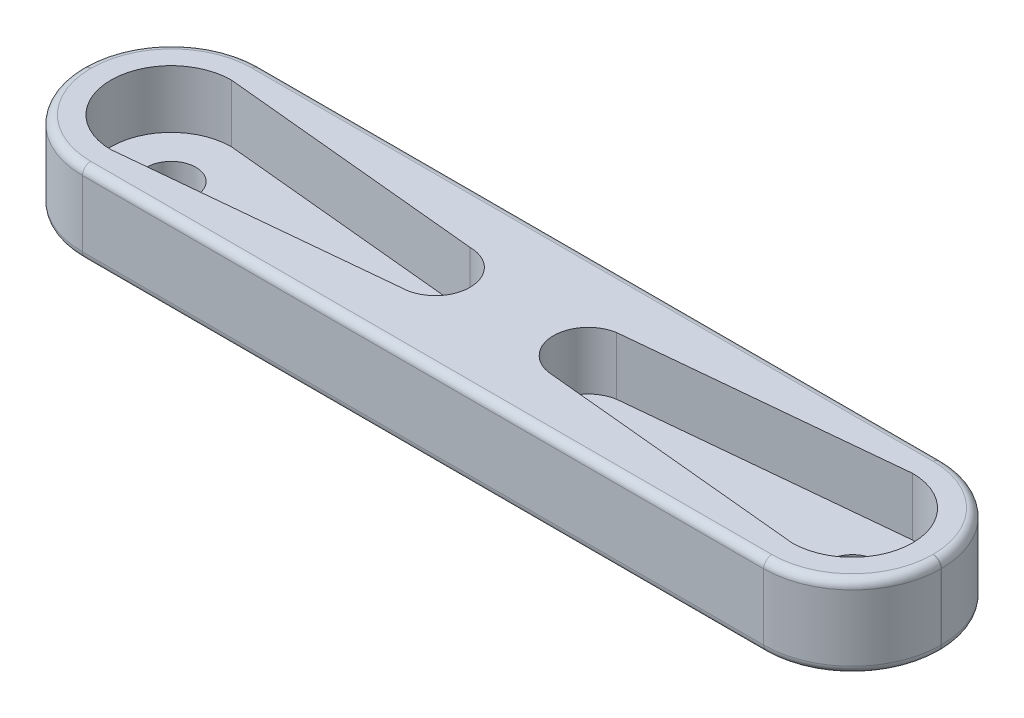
ISO-10303-21;
HEADER;
FILE_DESCRIPTION(('STEP AP214'),'2;1');
FILE_NAME('part.step','',(''),(''),'','','');
FILE_SCHEMA(('AUTOMOTIVE_DESIGN { 1 0 10303 214 1 1 1 1 }'));
ENDSEC;
DATA;
#1=APPLICATION_CONTEXT('core data for automotive mechanical design processes');
#2=APPLICATION_PROTOCOL_DEFINITION('international standard','automotive_design',2000,#1);
#3=PRODUCT_CONTEXT('',#1,'mechanical');
#4=PRODUCT('Part','Part','',(#3));
#5=PRODUCT_RELATED_PRODUCT_CATEGORY('part','',(#4));
#6=PRODUCT_DEFINITION_FORMATION('','',#4);
#7=PRODUCT_DEFINITION_CONTEXT('part definition',#1,'design');
#8=PRODUCT_DEFINITION('design','',#6,#7);
#9=PRODUCT_DEFINITION_SHAPE('','',#8);
#10=(LENGTH_UNIT() NAMED_UNIT(*) SI_UNIT(.MILLI.,.METRE.));
#11=(NAMED_UNIT(*) PLANE_ANGLE_UNIT() SI_UNIT($,.RADIAN.));
#12=(NAMED_UNIT(*) SI_UNIT($,.STERADIAN.) SOLID_ANGLE_UNIT());
#13=UNCERTAINTY_MEASURE_WITH_UNIT(LENGTH_MEASURE(1.E-05),#10,'distance_accuracy_value','');
#14=(GEOMETRIC_REPRESENTATION_CONTEXT(3) GLOBAL_UNCERTAINTY_ASSIGNED_CONTEXT((#13)) GLOBAL_UNIT_ASSIGNED_CONTEXT((#10,
#11,#12)) REPRESENTATION_CONTEXT('',''));
#15=CARTESIAN_POINT('',(0.,0.,0.));
#16=DIRECTION('',(0.,0.,1.));
#17=DIRECTION('',(1.,0.,0.));
#18=AXIS2_PLACEMENT_3D('',#15,#16,#17);
#19=CARTESIAN_POINT('',(0.,5.,0.));
#20=DIRECTION('',(0.,-1.,0.));
#21=DIRECTION('',(0.,0.,-1.));
#22=AXIS2_PLACEMENT_3D('',#19,#20,#21);
#23=PLANE('',#22);
#24=DIRECTION('',(0.,0.,1.));
#25=VECTOR('',#24,1.);
#26=CARTESIAN_POINT('',(-25.5,5.,0.));
#27=LINE('',#26,#25);
#28=CARTESIAN_POINT('',(-25.5,5.,-0.0149999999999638));
#29=VERTEX_POINT('',#28);
#30=CARTESIAN_POINT('',(-25.5,5.,0.0149999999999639));
#31=VERTEX_POINT('',#30);
#32=EDGE_CURVE('E49',#29,#31,#27,.T.);
#33=ORIENTED_EDGE('',*,*,#32,.T.);
#34=CARTESIAN_POINT('',(-20.63,5.,0.0149999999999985));
#35=DIRECTION('',(0.,-1.,0.));
#36=DIRECTION('',(0.,0.,-1.));
#37=AXIS2_PLACEMENT_3D('',#34,#35,#36);
#38=CIRCLE('',#37,4.87);
#39=CARTESIAN_POINT('',(-20.63,5.,4.885));
#40=VERTEX_POINT('',#39);
#41=EDGE_CURVE('E330',#31,#40,#38,.F.);
#42=ORIENTED_EDGE('',*,*,#41,.T.);
#43=DIRECTION('',(1.,0.,0.));
#44=VECTOR('',#43,1.);
#45=CARTESIAN_POINT('',(0.,5.,4.885));
#46=LINE('',#45,#44);
#47=CARTESIAN_POINT('',(20.63,5.,4.885));
#48=VERTEX_POINT('',#47);
#49=EDGE_CURVE('E318',#40,#48,#46,.T.);
#50=ORIENTED_EDGE('',*,*,#49,.T.);
#51=CARTESIAN_POINT('',(20.63,5.,0.0149999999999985));
#52=DIRECTION('',(0.,-1.,0.));
#53=DIRECTION('',(0.,0.,-1.));
#54=AXIS2_PLACEMENT_3D('',#51,#52,#53);
#55=CIRCLE('',#54,4.87);
#56=CARTESIAN_POINT('',(25.5,5.,0.0149999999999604));
#57=VERTEX_POINT('',#56);
#58=EDGE_CURVE('E320',#48,#57,#55,.F.);
#59=ORIENTED_EDGE('',*,*,#58,.T.);
#60=DIRECTION('',(0.,0.,-1.));
#61=VECTOR('',#60,1.);
#62=CARTESIAN_POINT('',(25.5,5.,0.));
#63=LINE('',#62,#61);
#64=CARTESIAN_POINT('',(25.5,5.,-0.0149999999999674));
#65=VERTEX_POINT('',#64);
#66=EDGE_CURVE('E322',#57,#65,#63,.T.);
#67=ORIENTED_EDGE('',*,*,#66,.T.);
#68=CARTESIAN_POINT('',(20.63,5.,-0.015000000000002));
#69=DIRECTION('',(0.,-1.,0.));
#70=DIRECTION('',(0.,0.,-1.));
#71=AXIS2_PLACEMENT_3D('',#68,#69,#70);
#72=CIRCLE('',#71,4.87);
#73=CARTESIAN_POINT('',(20.63,5.,-4.885));
#74=VERTEX_POINT('',#73);
#75=EDGE_CURVE('E324',#65,#74,#72,.F.);
#76=ORIENTED_EDGE('',*,*,#75,.T.);
#77=DIRECTION('',(-1.,0.,0.));
#78=VECTOR('',#77,1.);
#79=CARTESIAN_POINT('',(0.,5.,-4.885));
#80=LINE('',#79,#78);
#81=CARTESIAN_POINT('',(-20.63,5.,-4.885));
#82=VERTEX_POINT('',#81);
#83=EDGE_CURVE('E326',#74,#82,#80,.T.);
#84=ORIENTED_EDGE('',*,*,#83,.T.);
#85=CARTESIAN_POINT('',(-20.63,5.,-0.015000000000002));
#86=DIRECTION('',(0.,-1.,0.));
#87=DIRECTION('',(0.,0.,-1.));
#88=AXIS2_PLACEMENT_3D('',#85,#86,#87);
#89=CIRCLE('',#88,4.87);
#90=EDGE_CURVE('E54',#82,#29,#89,.F.);
#91=ORIENTED_EDGE('',*,*,#90,.T.);
#92=EDGE_LOOP('',(#33,#42,#50,#59,#67,#76,#84,#91));
#93=FACE_BOUND('',#92,.T.);
#94=CARTESIAN_POINT('',(-4.63000000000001,5.,0.0149999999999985));
#95=DIRECTION('',(0.,1.,0.));
#96=DIRECTION('',(0.,0.,1.));
#97=AXIS2_PLACEMENT_3D('',#94,#95,#96);
#98=CIRCLE('',#97,2.1);
#99=CARTESIAN_POINT('',(-4.63000000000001,5.,2.115));
#100=VERTEX_POINT('',#99);
#101=CARTESIAN_POINT('',(-4.63000000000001,5.,-2.085));
#102=VERTEX_POINT('',#101);
#103=EDGE_CURVE('E221',#100,#102,#98,.T.);
#104=ORIENTED_EDGE('',*,*,#103,.F.);
#105=DIRECTION('',(-0.995340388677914,0.,0.0964236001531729));
#106=VECTOR('',#105,1.);
#107=CARTESIAN_POINT('',(0.159938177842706,5.,1.65097473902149));
#108=LINE('',#107,#106);
#109=CARTESIAN_POINT('',(-20.63,5.,3.665));
#110=VERTEX_POINT('',#109);
#111=EDGE_CURVE('E212',#100,#110,#108,.T.);
#112=ORIENTED_EDGE('',*,*,#111,.T.);
#113=CARTESIAN_POINT('',(-20.63,5.,0.0149999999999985));
#114=DIRECTION('',(0.,1.,0.));
#115=DIRECTION('',(0.,0.,1.));
#116=AXIS2_PLACEMENT_3D('',#113,#114,#115);
#117=CIRCLE('',#116,3.65);
#118=CARTESIAN_POINT('',(-20.63,5.,-3.635));
#119=VERTEX_POINT('',#118);
#120=EDGE_CURVE('E206',#119,#110,#117,.T.);
#121=ORIENTED_EDGE('',*,*,#120,.F.);
#122=DIRECTION('',(0.995340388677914,0.,0.0964236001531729));
#123=VECTOR('',#122,1.);
#124=CARTESIAN_POINT('',(0.157058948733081,5.,-1.62125366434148));
#125=LINE('',#124,#123);
#126=EDGE_CURVE('E247',#119,#102,#125,.T.);
#127=ORIENTED_EDGE('',*,*,#126,.T.);
#128=EDGE_LOOP('',(#104,#112,#121,#127));
#129=FACE_BOUND('',#128,.T.);
#130=DIRECTION('',(-0.99536604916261,0.,-0.0961583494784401));
#131=VECTOR('',#130,1.);
#132=CARTESIAN_POINT('',(-0.160033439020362,5.,1.65655767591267));
#133=LINE('',#132,#131);
#134=CARTESIAN_POINT('',(20.63,5.,3.665));
#135=VERTEX_POINT('',#134);
#136=CARTESIAN_POINT('',(4.27813001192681,5.,2.08531096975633));
#137=VERTEX_POINT('',#136);
#138=EDGE_CURVE('E266',#135,#137,#133,.T.);
#139=ORIENTED_EDGE('',*,*,#138,.T.);
#140=CARTESIAN_POINT('',(4.62999999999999,5.,0.0150000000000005));
#141=DIRECTION('',(0.,1.,0.));
#142=DIRECTION('',(0.,0.,1.));
#143=AXIS2_PLACEMENT_3D('',#140,#141,#142);
#144=CIRCLE('',#143,2.1);
#145=CARTESIAN_POINT('',(4.27813001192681,5.,-2.05531096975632));
#146=VERTEX_POINT('',#145);
#147=EDGE_CURVE('E235',#146,#137,#144,.T.);
#148=ORIENTED_EDGE('',*,*,#147,.F.);
#149=DIRECTION('',(-0.995366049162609,0.,0.0961583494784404));
#150=VECTOR('',#149,1.);
#151=CARTESIAN_POINT('',(-0.157162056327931,5.,-1.6268350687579));
#152=LINE('',#151,#150);
#153=CARTESIAN_POINT('',(20.63,5.,-3.635));
#154=VERTEX_POINT('',#153);
#155=EDGE_CURVE('E229',#154,#146,#152,.T.);
#156=ORIENTED_EDGE('',*,*,#155,.F.);
#157=CARTESIAN_POINT('',(20.63,5.,0.0149999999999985));
#158=DIRECTION('',(0.,1.,0.));
#159=DIRECTION('',(0.,0.,1.));
#160=AXIS2_PLACEMENT_3D('',#157,#158,#159);
#161=CIRCLE('',#160,3.65);
#162=EDGE_CURVE('E259',#135,#154,#161,.T.);
#163=ORIENTED_EDGE('',*,*,#162,.F.);
#164=EDGE_LOOP('',(#139,#148,#156,#163));
#165=FACE_BOUND('',#164,.T.);
#166=ADVANCED_FACE('F32',(#93,#129,#165),#23,.F.);
#167=CARTESIAN_POINT('',(-26.,5.,-5.385));
#168=DIRECTION('',(0.,0.,1.));
#169=DIRECTION('',(1.,0.,0.));
#170=AXIS2_PLACEMENT_3D('',#167,#168,#169);
#171=PLANE('',#170);
#172=DIRECTION('',(0.,1.,0.));
#173=VECTOR('',#172,1.);
#174=CARTESIAN_POINT('',(20.63,0.,-5.385));
#175=LINE('',#174,#173);
#176=CARTESIAN_POINT('',(20.63,0.5,-5.385));
#177=VERTEX_POINT('',#176);
#178=CARTESIAN_POINT('',(20.63,4.5,-5.385));
#179=VERTEX_POINT('',#178);
#180=EDGE_CURVE('E395',#177,#179,#175,.T.);
#181=ORIENTED_EDGE('',*,*,#180,.F.);
#182=DIRECTION('',(-1.,0.,0.));
#183=VECTOR('',#182,1.);
#184=CARTESIAN_POINT('',(-20.63,0.5,-5.385));
#185=LINE('',#184,#183);
#186=CARTESIAN_POINT('',(-20.63,0.5,-5.385));
#187=VERTEX_POINT('',#186);
#188=EDGE_CURVE('E304',#177,#187,#185,.T.);
#189=ORIENTED_EDGE('',*,*,#188,.T.);
#190=DIRECTION('',(0.,1.,0.));
#191=VECTOR('',#190,1.);
#192=CARTESIAN_POINT('',(-20.63,0.,-5.385));
#193=LINE('',#192,#191);
#194=CARTESIAN_POINT('',(-20.63,4.5,-5.385));
#195=VERTEX_POINT('',#194);
#196=EDGE_CURVE('E226',#187,#195,#193,.T.);
#197=ORIENTED_EDGE('',*,*,#196,.T.);
#198=DIRECTION('',(-1.,0.,0.));
#199=VECTOR('',#198,1.);
#200=CARTESIAN_POINT('',(-26.,4.5,-5.385));
#201=LINE('',#200,#199);
#202=EDGE_CURVE('E302',#195,#179,#201,.F.);
#203=ORIENTED_EDGE('',*,*,#202,.T.);
#204=EDGE_LOOP('',(#181,#189,#197,#203));
#205=FACE_BOUND('',#204,.T.);
#206=ADVANCED_FACE('F496',(#205),#171,.F.);
#207=CARTESIAN_POINT('',(-26.,5.,5.385));
#208=DIRECTION('',(1.,0.,0.));
#209=DIRECTION('',(0.,0.,-1.));
#210=AXIS2_PLACEMENT_3D('',#207,#208,#209);
#211=PLANE('',#210);
#212=DIRECTION('',(0.,1.,0.));
#213=VECTOR('',#212,1.);
#214=CARTESIAN_POINT('',(-26.,0.,-0.0149999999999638));
#215=LINE('',#214,#213);
#216=CARTESIAN_POINT('',(-26.,0.5,-0.0149999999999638));
#217=VERTEX_POINT('',#216);
#218=CARTESIAN_POINT('',(-26.,4.5,-0.0149999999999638));
#219=VERTEX_POINT('',#218);
#220=EDGE_CURVE('E238',#217,#219,#215,.T.);
#221=ORIENTED_EDGE('',*,*,#220,.F.);
#222=DIRECTION('',(0.,0.,1.));
#223=VECTOR('',#222,1.);
#224=CARTESIAN_POINT('',(-26.,0.5,0.0149999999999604));
#225=LINE('',#224,#223);
#226=CARTESIAN_POINT('',(-26.,0.5,0.0149999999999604));
#227=VERTEX_POINT('',#226);
#228=EDGE_CURVE('E296',#217,#227,#225,.T.);
#229=ORIENTED_EDGE('',*,*,#228,.T.);
#230=DIRECTION('',(0.,1.,0.));
#231=VECTOR('',#230,1.);
#232=CARTESIAN_POINT('',(-26.,0.,0.0149999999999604));
#233=LINE('',#232,#231);
#234=CARTESIAN_POINT('',(-26.,4.5,0.0149999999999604));
#235=VERTEX_POINT('',#234);
#236=EDGE_CURVE('E418',#227,#235,#233,.T.);
#237=ORIENTED_EDGE('',*,*,#236,.T.);
#238=DIRECTION('',(0.,0.,1.));
#239=VECTOR('',#238,1.);
#240=CARTESIAN_POINT('',(-26.,4.5,5.385));
#241=LINE('',#240,#239);
#242=EDGE_CURVE('E294',#235,#219,#241,.F.);
#243=ORIENTED_EDGE('',*,*,#242,.T.);
#244=EDGE_LOOP('',(#221,#229,#237,#243));
#245=FACE_BOUND('',#244,.T.);
#246=ADVANCED_FACE('F501',(#245),#211,.F.);
#247=CARTESIAN_POINT('',(-26.,5.,5.385));
#248=DIRECTION('',(0.,0.,-1.));
#249=DIRECTION('',(-1.,0.,0.));
#250=AXIS2_PLACEMENT_3D('',#247,#248,#249);
#251=PLANE('',#250);
#252=DIRECTION('',(0.,1.,0.));
#253=VECTOR('',#252,1.);
#254=CARTESIAN_POINT('',(-20.63,0.,5.385));
#255=LINE('',#254,#253);
#256=CARTESIAN_POINT('',(-20.63,0.5,5.385));
#257=VERTEX_POINT('',#256);
#258=CARTESIAN_POINT('',(-20.63,4.5,5.385));
#259=VERTEX_POINT('',#258);
#260=EDGE_CURVE('E414',#257,#259,#255,.T.);
#261=ORIENTED_EDGE('',*,*,#260,.F.);
#262=DIRECTION('',(1.,0.,0.));
#263=VECTOR('',#262,1.);
#264=CARTESIAN_POINT('',(20.63,0.5,5.385));
#265=LINE('',#264,#263);
#266=CARTESIAN_POINT('',(20.63,0.5,5.385));
#267=VERTEX_POINT('',#266);
#268=EDGE_CURVE('E11',#257,#267,#265,.T.);
#269=ORIENTED_EDGE('',*,*,#268,.T.);
#270=DIRECTION('',(0.,1.,0.));
#271=VECTOR('',#270,1.);
#272=CARTESIAN_POINT('',(20.63,0.,5.385));
#273=LINE('',#272,#271);
#274=CARTESIAN_POINT('',(20.63,4.5,5.385));
#275=VERTEX_POINT('',#274);
#276=EDGE_CURVE('E424',#267,#275,#273,.T.);
#277=ORIENTED_EDGE('',*,*,#276,.T.);
#278=DIRECTION('',(1.,0.,0.));
#279=VECTOR('',#278,1.);
#280=CARTESIAN_POINT('',(-26.,4.5,5.385));
#281=LINE('',#280,#279);
#282=EDGE_CURVE('E41',#275,#259,#281,.F.);
#283=ORIENTED_EDGE('',*,*,#282,.T.);
#284=EDGE_LOOP('',(#261,#269,#277,#283));
#285=FACE_BOUND('',#284,.T.);
#286=ADVANCED_FACE('F446',(#285),#251,.F.);
#287=CARTESIAN_POINT('',(0.,0.,0.));
#288=DIRECTION('',(0.,-1.,0.));
#289=DIRECTION('',(0.,0.,-1.));
#290=AXIS2_PLACEMENT_3D('',#287,#288,#289);
#291=PLANE('',#290);
#292=DIRECTION('',(1.,0.,0.));
#293=VECTOR('',#292,1.);
#294=CARTESIAN_POINT('',(-20.63,0.,4.885));
#295=LINE('',#294,#293);
#296=CARTESIAN_POINT('',(20.63,0.,4.885));
#297=VERTEX_POINT('',#296);
#298=CARTESIAN_POINT('',(-20.63,0.,4.885));
#299=VERTEX_POINT('',#298);
#300=EDGE_CURVE('E277',#297,#299,#295,.F.);
#301=ORIENTED_EDGE('',*,*,#300,.T.);
#302=CARTESIAN_POINT('',(-20.63,0.,0.0149999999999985));
#303=DIRECTION('',(0.,-1.,0.));
#304=DIRECTION('',(0.,0.,-1.));
#305=AXIS2_PLACEMENT_3D('',#302,#303,#304);
#306=CIRCLE('',#305,4.87);
#307=CARTESIAN_POINT('',(-25.5,0.,0.0149999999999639));
#308=VERTEX_POINT('',#307);
#309=EDGE_CURVE('E291',#299,#308,#306,.T.);
#310=ORIENTED_EDGE('',*,*,#309,.T.);
#311=DIRECTION('',(0.,0.,1.));
#312=VECTOR('',#311,1.);
#313=CARTESIAN_POINT('',(-25.5,0.,-0.0149999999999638));
#314=LINE('',#313,#312);
#315=CARTESIAN_POINT('',(-25.5,0.,-0.0149999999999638));
#316=VERTEX_POINT('',#315);
#317=EDGE_CURVE('E289',#308,#316,#314,.F.);
#318=ORIENTED_EDGE('',*,*,#317,.T.);
#319=CARTESIAN_POINT('',(-20.63,0.,-0.015000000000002));
#320=DIRECTION('',(0.,-1.,0.));
#321=DIRECTION('',(0.,0.,-1.));
#322=AXIS2_PLACEMENT_3D('',#319,#320,#321);
#323=CIRCLE('',#322,4.87);
#324=CARTESIAN_POINT('',(-20.63,0.,-4.885));
#325=VERTEX_POINT('',#324);
#326=EDGE_CURVE('E287',#316,#325,#323,.T.);
#327=ORIENTED_EDGE('',*,*,#326,.T.);
#328=DIRECTION('',(-1.,0.,0.));
#329=VECTOR('',#328,1.);
#330=CARTESIAN_POINT('',(20.6299999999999,0.,-4.885));
#331=LINE('',#330,#329);
#332=CARTESIAN_POINT('',(20.63,0.,-4.885));
#333=VERTEX_POINT('',#332);
#334=EDGE_CURVE('E285',#325,#333,#331,.F.);
#335=ORIENTED_EDGE('',*,*,#334,.T.);
#336=CARTESIAN_POINT('',(20.63,0.,-0.015000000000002));
#337=DIRECTION('',(0.,-1.,0.));
#338=DIRECTION('',(0.,0.,-1.));
#339=AXIS2_PLACEMENT_3D('',#336,#337,#338);
#340=CIRCLE('',#339,4.87);
#341=CARTESIAN_POINT('',(25.5,0.,-0.0149999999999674));
#342=VERTEX_POINT('',#341);
#343=EDGE_CURVE('E283',#333,#342,#340,.T.);
#344=ORIENTED_EDGE('',*,*,#343,.T.);
#345=DIRECTION('',(0.,0.,-1.));
#346=VECTOR('',#345,1.);
#347=CARTESIAN_POINT('',(25.5,0.,0.0149999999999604));
#348=LINE('',#347,#346);
#349=CARTESIAN_POINT('',(25.5,0.,0.0149999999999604));
#350=VERTEX_POINT('',#349);
#351=EDGE_CURVE('E281',#342,#350,#348,.F.);
#352=ORIENTED_EDGE('',*,*,#351,.T.);
#353=CARTESIAN_POINT('',(20.63,0.,0.0149999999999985));
#354=DIRECTION('',(0.,-1.,0.));
#355=DIRECTION('',(0.,0.,-1.));
#356=AXIS2_PLACEMENT_3D('',#353,#354,#355);
#357=CIRCLE('',#356,4.87);
#358=EDGE_CURVE('E279',#350,#297,#357,.T.);
#359=ORIENTED_EDGE('',*,*,#358,.T.);
#360=EDGE_LOOP('',(#301,#310,#318,#327,#335,#344,#352,#359));
#361=FACE_BOUND('',#360,.T.);
#362=CARTESIAN_POINT('',(-20.63,0.,0.0149999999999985));
#363=DIRECTION('',(0.,1.,0.));
#364=DIRECTION('',(0.,0.,1.));
#365=AXIS2_PLACEMENT_3D('',#362,#363,#364);
#366=CIRCLE('',#365,1.5);
#367=CARTESIAN_POINT('',(-20.63,0.,1.515));
#368=VERTEX_POINT('',#367);
#369=EDGE_CURVE('E834',#368,#368,#366,.T.);
#370=ORIENTED_EDGE('',*,*,#369,.T.);
#371=EDGE_LOOP('',(#370));
#372=FACE_BOUND('',#371,.T.);
#373=CARTESIAN_POINT('',(20.63,0.,0.0149999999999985));
#374=DIRECTION('',(0.,1.,0.));
#375=DIRECTION('',(0.,0.,1.));
#376=AXIS2_PLACEMENT_3D('',#373,#374,#375);
#377=CIRCLE('',#376,1.5);
#378=CARTESIAN_POINT('',(20.63,0.,1.515));
#379=VERTEX_POINT('',#378);
#380=EDGE_CURVE('E355',#379,#379,#377,.T.);
#381=ORIENTED_EDGE('',*,*,#380,.T.);
#382=EDGE_LOOP('',(#381));
#383=FACE_BOUND('',#382,.T.);
#384=ADVANCED_FACE('F459',(#361,#372,#383),#291,.T.);
#385=CARTESIAN_POINT('',(26.,5.,5.385));
#386=DIRECTION('',(-1.,0.,0.));
#387=DIRECTION('',(0.,0.,1.));
#388=AXIS2_PLACEMENT_3D('',#385,#386,#387);
#389=PLANE('',#388);
#390=DIRECTION('',(0.,1.,0.));
#391=VECTOR('',#390,1.);
#392=CARTESIAN_POINT('',(26.,0.,0.0149999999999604));
#393=LINE('',#392,#391);
#394=CARTESIAN_POINT('',(26.,0.5,0.0149999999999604));
#395=VERTEX_POINT('',#394);
#396=CARTESIAN_POINT('',(26.,4.5,0.0149999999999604));
#397=VERTEX_POINT('',#396);
#398=EDGE_CURVE('E403',#395,#397,#393,.T.);
#399=ORIENTED_EDGE('',*,*,#398,.F.);
#400=DIRECTION('',(0.,0.,-1.));
#401=VECTOR('',#400,1.);
#402=CARTESIAN_POINT('',(26.,0.5,-0.0149999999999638));
#403=LINE('',#402,#401);
#404=CARTESIAN_POINT('',(26.,0.5,-0.0149999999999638));
#405=VERTEX_POINT('',#404);
#406=EDGE_CURVE('E312',#395,#405,#403,.T.);
#407=ORIENTED_EDGE('',*,*,#406,.T.);
#408=DIRECTION('',(0.,1.,0.));
#409=VECTOR('',#408,1.);
#410=CARTESIAN_POINT('',(26.,0.,-0.0149999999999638));
#411=LINE('',#410,#409);
#412=CARTESIAN_POINT('',(26.,4.5,-0.0149999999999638));
#413=VERTEX_POINT('',#412);
#414=EDGE_CURVE('E392',#405,#413,#411,.T.);
#415=ORIENTED_EDGE('',*,*,#414,.T.);
#416=DIRECTION('',(0.,0.,-1.));
#417=VECTOR('',#416,1.);
#418=CARTESIAN_POINT('',(26.,4.5,5.385));
#419=LINE('',#418,#417);
#420=EDGE_CURVE('E310',#413,#397,#419,.F.);
#421=ORIENTED_EDGE('',*,*,#420,.T.);
#422=EDGE_LOOP('',(#399,#407,#415,#421));
#423=FACE_BOUND('',#422,.T.);
#424=ADVANCED_FACE('F398',(#423),#389,.F.);
#425=CARTESIAN_POINT('',(-0.157162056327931,1.5,-1.6268350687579));
#426=DIRECTION('',(-0.0961583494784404,0.,-0.995366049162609));
#427=DIRECTION('',(-0.995366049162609,0.,0.0961583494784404));
#428=AXIS2_PLACEMENT_3D('',#425,#426,#427);
#429=PLANE('',#428);
#430=ORIENTED_EDGE('',*,*,#155,.T.);
#431=DIRECTION('',(0.,1.,0.));
#432=VECTOR('',#431,1.);
#433=CARTESIAN_POINT('',(4.27813001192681,1.5,-2.05531096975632));
#434=LINE('',#433,#432);
#435=CARTESIAN_POINT('',(4.27813001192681,1.5,-2.05531096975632));
#436=VERTEX_POINT('',#435);
#437=EDGE_CURVE('E234',#436,#146,#434,.T.);
#438=ORIENTED_EDGE('',*,*,#437,.F.);
#439=DIRECTION('',(-0.995366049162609,0.,0.0961583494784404));
#440=VECTOR('',#439,1.);
#441=CARTESIAN_POINT('',(-0.157162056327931,1.5,-1.6268350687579));
#442=LINE('',#441,#440);
#443=CARTESIAN_POINT('',(20.63,1.5,-3.635));
#444=VERTEX_POINT('',#443);
#445=EDGE_CURVE('E256',#444,#436,#442,.T.);
#446=ORIENTED_EDGE('',*,*,#445,.F.);
#447=DIRECTION('',(0.,1.,0.));
#448=VECTOR('',#447,1.);
#449=CARTESIAN_POINT('',(20.63,1.5,-3.635));
#450=LINE('',#449,#448);
#451=EDGE_CURVE('E248',#444,#154,#450,.T.);
#452=ORIENTED_EDGE('',*,*,#451,.T.);
#453=EDGE_LOOP('',(#430,#438,#446,#452));
#454=FACE_BOUND('',#453,.T.);
#455=ADVANCED_FACE('F506',(#454),#429,.F.);
#456=CARTESIAN_POINT('',(20.63,1.5,0.0149999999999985));
#457=DIRECTION('',(0.,1.,0.));
#458=DIRECTION('',(0.,0.,1.));
#459=AXIS2_PLACEMENT_3D('',#456,#457,#458);
#460=CYLINDRICAL_SURFACE('',#459,3.65);
#461=ORIENTED_EDGE('',*,*,#162,.T.);
#462=ORIENTED_EDGE('',*,*,#451,.F.);
#463=CARTESIAN_POINT('',(20.63,1.5,0.0149999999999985));
#464=DIRECTION('',(0.,1.,0.));
#465=DIRECTION('',(0.,0.,1.));
#466=AXIS2_PLACEMENT_3D('',#463,#464,#465);
#467=CIRCLE('',#466,3.65);
#468=CARTESIAN_POINT('',(20.63,1.5,3.665));
#469=VERTEX_POINT('',#468);
#470=EDGE_CURVE('E260',#469,#444,#467,.T.);
#471=ORIENTED_EDGE('',*,*,#470,.F.);
#472=DIRECTION('',(0.,1.,0.));
#473=VECTOR('',#472,1.);
#474=CARTESIAN_POINT('',(20.63,1.5,3.665));
#475=LINE('',#474,#473);
#476=EDGE_CURVE('E263',#469,#135,#475,.T.);
#477=ORIENTED_EDGE('',*,*,#476,.T.);
#478=EDGE_LOOP('',(#461,#462,#471,#477));
#479=FACE_BOUND('',#478,.T.);
#480=ADVANCED_FACE('F781',(#479),#460,.F.);
#481=CARTESIAN_POINT('',(-0.160033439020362,1.5,1.65655767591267));
#482=DIRECTION('',(0.0961583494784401,0.,-0.995366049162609));
#483=DIRECTION('',(-0.99536604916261,0.,-0.0961583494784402));
#484=AXIS2_PLACEMENT_3D('',#481,#482,#483);
#485=PLANE('',#484);
#486=ORIENTED_EDGE('',*,*,#138,.F.);
#487=ORIENTED_EDGE('',*,*,#476,.F.);
#488=DIRECTION('',(-0.99536604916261,0.,-0.0961583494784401));
#489=VECTOR('',#488,1.);
#490=CARTESIAN_POINT('',(-0.160033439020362,1.5,1.65655767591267));
#491=LINE('',#490,#489);
#492=CARTESIAN_POINT('',(4.27813001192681,1.5,2.08531096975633));
#493=VERTEX_POINT('',#492);
#494=EDGE_CURVE('E258',#469,#493,#491,.T.);
#495=ORIENTED_EDGE('',*,*,#494,.T.);
#496=DIRECTION('',(0.,1.,0.));
#497=VECTOR('',#496,1.);
#498=CARTESIAN_POINT('',(4.27813001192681,1.5,2.08531096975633));
#499=LINE('',#498,#497);
#500=EDGE_CURVE('E223',#493,#137,#499,.T.);
#501=ORIENTED_EDGE('',*,*,#500,.T.);
#502=EDGE_LOOP('',(#486,#487,#495,#501));
#503=FACE_BOUND('',#502,.T.);
#504=ADVANCED_FACE('F770',(#503),#485,.T.);
#505=CARTESIAN_POINT('',(0.,1.5,0.));
#506=DIRECTION('',(0.,1.,0.));
#507=DIRECTION('',(0.,0.,1.));
#508=AXIS2_PLACEMENT_3D('',#505,#506,#507);
#509=PLANE('',#508);
#510=ORIENTED_EDGE('',*,*,#445,.T.);
#511=CARTESIAN_POINT('',(4.62999999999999,1.5,0.0150000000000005));
#512=DIRECTION('',(0.,1.,0.));
#513=DIRECTION('',(0.,0.,1.));
#514=AXIS2_PLACEMENT_3D('',#511,#512,#513);
#515=CIRCLE('',#514,2.1);
#516=EDGE_CURVE('E231',#436,#493,#515,.T.);
#517=ORIENTED_EDGE('',*,*,#516,.T.);
#518=ORIENTED_EDGE('',*,*,#494,.F.);
#519=ORIENTED_EDGE('',*,*,#470,.T.);
#520=EDGE_LOOP('',(#510,#517,#518,#519));
#521=FACE_BOUND('',#520,.T.);
#522=CARTESIAN_POINT('',(20.63,1.5,0.0149999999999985));
#523=DIRECTION('',(0.,1.,0.));
#524=DIRECTION('',(0.,0.,1.));
#525=AXIS2_PLACEMENT_3D('',#522,#523,#524);
#526=CIRCLE('',#525,1.5);
#527=CARTESIAN_POINT('',(20.63,1.5,1.515));
#528=VERTEX_POINT('',#527);
#529=EDGE_CURVE('E401',#528,#528,#526,.T.);
#530=ORIENTED_EDGE('',*,*,#529,.F.);
#531=EDGE_LOOP('',(#530));
#532=FACE_BOUND('',#531,.T.);
#533=ADVANCED_FACE('F759',(#521,#532),#509,.T.);
#534=CARTESIAN_POINT('',(0.159938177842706,1.5,1.65097473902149));
#535=DIRECTION('',(-0.0964236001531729,0.,-0.995340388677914));
#536=DIRECTION('',(-0.995340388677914,0.,0.0964236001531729));
#537=AXIS2_PLACEMENT_3D('',#534,#535,#536);
#538=PLANE('',#537);
#539=ORIENTED_EDGE('',*,*,#111,.F.);
#540=DIRECTION('',(0.,1.,0.));
#541=VECTOR('',#540,1.);
#542=CARTESIAN_POINT('',(-4.63000000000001,1.5,2.115));
#543=LINE('',#542,#541);
#544=CARTESIAN_POINT('',(-4.63000000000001,1.5,2.115));
#545=VERTEX_POINT('',#544);
#546=EDGE_CURVE('E209',#545,#100,#543,.T.);
#547=ORIENTED_EDGE('',*,*,#546,.F.);
#548=DIRECTION('',(-0.995340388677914,0.,0.0964236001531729));
#549=VECTOR('',#548,1.);
#550=CARTESIAN_POINT('',(0.159938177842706,1.5,1.65097473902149));
#551=LINE('',#550,#549);
#552=CARTESIAN_POINT('',(-20.63,1.5,3.665));
#553=VERTEX_POINT('',#552);
#554=EDGE_CURVE('E194',#545,#553,#551,.T.);
#555=ORIENTED_EDGE('',*,*,#554,.T.);
#556=DIRECTION('',(0.,1.,0.));
#557=VECTOR('',#556,1.);
#558=CARTESIAN_POINT('',(-20.63,1.5,3.665));
#559=LINE('',#558,#557);
#560=EDGE_CURVE('E252',#553,#110,#559,.T.);
#561=ORIENTED_EDGE('',*,*,#560,.T.);
#562=EDGE_LOOP('',(#539,#547,#555,#561));
#563=FACE_BOUND('',#562,.T.);
#564=ADVANCED_FACE('F210',(#563),#538,.T.);
#565=CARTESIAN_POINT('',(-20.63,1.5,0.0149999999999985));
#566=DIRECTION('',(0.,1.,0.));
#567=DIRECTION('',(0.,0.,1.));
#568=AXIS2_PLACEMENT_3D('',#565,#566,#567);
#569=CYLINDRICAL_SURFACE('',#568,3.65);
#570=ORIENTED_EDGE('',*,*,#120,.T.);
#571=ORIENTED_EDGE('',*,*,#560,.F.);
#572=CARTESIAN_POINT('',(-20.63,1.5,0.0149999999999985));
#573=DIRECTION('',(0.,1.,0.));
#574=DIRECTION('',(0.,0.,1.));
#575=AXIS2_PLACEMENT_3D('',#572,#573,#574);
#576=CIRCLE('',#575,3.65);
#577=CARTESIAN_POINT('',(-20.63,1.5,-3.635));
#578=VERTEX_POINT('',#577);
#579=EDGE_CURVE('E202',#578,#553,#576,.T.);
#580=ORIENTED_EDGE('',*,*,#579,.F.);
#581=DIRECTION('',(0.,1.,0.));
#582=VECTOR('',#581,1.);
#583=CARTESIAN_POINT('',(-20.63,1.5,-3.635));
#584=LINE('',#583,#582);
#585=EDGE_CURVE('E244',#578,#119,#584,.T.);
#586=ORIENTED_EDGE('',*,*,#585,.T.);
#587=EDGE_LOOP('',(#570,#571,#580,#586));
#588=FACE_BOUND('',#587,.T.);
#589=ADVANCED_FACE('F746',(#588),#569,.F.);
#590=CARTESIAN_POINT('',(0.157058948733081,1.5,-1.62125366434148));
#591=DIRECTION('',(-0.0964236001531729,0.,0.995340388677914));
#592=DIRECTION('',(0.995340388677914,0.,0.0964236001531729));
#593=AXIS2_PLACEMENT_3D('',#590,#591,#592);
#594=PLANE('',#593);
#595=ORIENTED_EDGE('',*,*,#126,.F.);
#596=ORIENTED_EDGE('',*,*,#585,.F.);
#597=DIRECTION('',(0.995340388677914,0.,0.0964236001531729));
#598=VECTOR('',#597,1.);
#599=CARTESIAN_POINT('',(0.157058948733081,1.5,-1.62125366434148));
#600=LINE('',#599,#598);
#601=CARTESIAN_POINT('',(-4.63000000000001,1.5,-2.085));
#602=VERTEX_POINT('',#601);
#603=EDGE_CURVE('E205',#578,#602,#600,.T.);
#604=ORIENTED_EDGE('',*,*,#603,.T.);
#605=DIRECTION('',(0.,1.,0.));
#606=VECTOR('',#605,1.);
#607=CARTESIAN_POINT('',(-4.63000000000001,1.5,-2.085));
#608=LINE('',#607,#606);
#609=EDGE_CURVE('E216',#602,#102,#608,.T.);
#610=ORIENTED_EDGE('',*,*,#609,.T.);
#611=EDGE_LOOP('',(#595,#596,#604,#610));
#612=FACE_BOUND('',#611,.T.);
#613=ADVANCED_FACE('F734',(#612),#594,.T.);
#614=CARTESIAN_POINT('',(0.,1.5,0.));
#615=DIRECTION('',(0.,1.,0.));
#616=DIRECTION('',(0.,0.,1.));
#617=AXIS2_PLACEMENT_3D('',#614,#615,#616);
#618=PLANE('',#617);
#619=ORIENTED_EDGE('',*,*,#554,.F.);
#620=CARTESIAN_POINT('',(-4.63000000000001,1.5,0.0149999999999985));
#621=DIRECTION('',(0.,1.,0.));
#622=DIRECTION('',(0.,0.,1.));
#623=AXIS2_PLACEMENT_3D('',#620,#621,#622);
#624=CIRCLE('',#623,2.1);
#625=EDGE_CURVE('E200',#545,#602,#624,.T.);
#626=ORIENTED_EDGE('',*,*,#625,.T.);
#627=ORIENTED_EDGE('',*,*,#603,.F.);
#628=ORIENTED_EDGE('',*,*,#579,.T.);
#629=EDGE_LOOP('',(#619,#626,#627,#628));
#630=FACE_BOUND('',#629,.T.);
#631=CARTESIAN_POINT('',(-20.63,1.5,0.0149999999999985));
#632=DIRECTION('',(0.,1.,0.));
#633=DIRECTION('',(0.,0.,1.));
#634=AXIS2_PLACEMENT_3D('',#631,#632,#633);
#635=CIRCLE('',#634,1.5);
#636=CARTESIAN_POINT('',(-20.63,1.5,1.515));
#637=VERTEX_POINT('',#636);
#638=EDGE_CURVE('E406',#637,#637,#635,.T.);
#639=ORIENTED_EDGE('',*,*,#638,.F.);
#640=EDGE_LOOP('',(#639));
#641=FACE_BOUND('',#640,.T.);
#642=ADVANCED_FACE('F196',(#630,#641),#618,.T.);
#643=CARTESIAN_POINT('',(-4.63000000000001,1.5,0.0149999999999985));
#644=DIRECTION('',(0.,1.,0.));
#645=DIRECTION('',(0.,0.,1.));
#646=AXIS2_PLACEMENT_3D('',#643,#644,#645);
#647=CYLINDRICAL_SURFACE('',#646,2.1);
#648=ORIENTED_EDGE('',*,*,#103,.T.);
#649=ORIENTED_EDGE('',*,*,#609,.F.);
#650=ORIENTED_EDGE('',*,*,#625,.F.);
#651=ORIENTED_EDGE('',*,*,#546,.T.);
#652=EDGE_LOOP('',(#648,#649,#650,#651));
#653=FACE_BOUND('',#652,.T.);
#654=ADVANCED_FACE('F219',(#653),#647,.F.);
#655=CARTESIAN_POINT('',(4.62999999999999,1.5,0.0150000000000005));
#656=DIRECTION('',(0.,1.,0.));
#657=DIRECTION('',(0.,0.,1.));
#658=AXIS2_PLACEMENT_3D('',#655,#656,#657);
#659=CYLINDRICAL_SURFACE('',#658,2.1);
#660=ORIENTED_EDGE('',*,*,#147,.T.);
#661=ORIENTED_EDGE('',*,*,#500,.F.);
#662=ORIENTED_EDGE('',*,*,#516,.F.);
#663=ORIENTED_EDGE('',*,*,#437,.T.);
#664=EDGE_LOOP('',(#660,#661,#662,#663));
#665=FACE_BOUND('',#664,.T.);
#666=ADVANCED_FACE('F686',(#665),#659,.F.);
#667=CARTESIAN_POINT('',(-20.63,0.,-0.015000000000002));
#668=DIRECTION('',(0.,1.,0.));
#669=DIRECTION('',(0.,0.,1.));
#670=AXIS2_PLACEMENT_3D('',#667,#668,#669);
#671=CYLINDRICAL_SURFACE('',#670,5.37);
#672=ORIENTED_EDGE('',*,*,#196,.F.);
#673=CARTESIAN_POINT('',(-20.63,0.5,-0.015000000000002));
#674=DIRECTION('',(0.,-1.,0.));
#675=DIRECTION('',(0.,0.,-1.));
#676=AXIS2_PLACEMENT_3D('',#673,#674,#675);
#677=CIRCLE('',#676,5.37);
#678=EDGE_CURVE('E300',#187,#217,#677,.F.);
#679=ORIENTED_EDGE('',*,*,#678,.T.);
#680=ORIENTED_EDGE('',*,*,#220,.T.);
#681=CARTESIAN_POINT('',(-20.63,4.5,-0.015000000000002));
#682=DIRECTION('',(0.,-1.,0.));
#683=DIRECTION('',(0.,0.,-1.));
#684=AXIS2_PLACEMENT_3D('',#681,#682,#683);
#685=CIRCLE('',#684,5.37);
#686=EDGE_CURVE('E298',#219,#195,#685,.T.);
#687=ORIENTED_EDGE('',*,*,#686,.T.);
#688=EDGE_LOOP('',(#672,#679,#680,#687));
#689=FACE_BOUND('',#688,.T.);
#690=ADVANCED_FACE('F678',(#689),#671,.T.);
#691=CARTESIAN_POINT('',(-20.63,0.,0.0149999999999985));
#692=DIRECTION('',(0.,1.,0.));
#693=DIRECTION('',(0.,0.,1.));
#694=AXIS2_PLACEMENT_3D('',#691,#692,#693);
#695=CYLINDRICAL_SURFACE('',#694,5.37);
#696=ORIENTED_EDGE('',*,*,#236,.F.);
#697=CARTESIAN_POINT('',(-20.63,0.5,0.0149999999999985));
#698=DIRECTION('',(0.,-1.,0.));
#699=DIRECTION('',(0.,0.,-1.));
#700=AXIS2_PLACEMENT_3D('',#697,#698,#699);
#701=CIRCLE('',#700,5.37);
#702=EDGE_CURVE('E274',#227,#257,#701,.F.);
#703=ORIENTED_EDGE('',*,*,#702,.T.);
#704=ORIENTED_EDGE('',*,*,#260,.T.);
#705=CARTESIAN_POINT('',(-20.63,4.5,0.0149999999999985));
#706=DIRECTION('',(0.,-1.,0.));
#707=DIRECTION('',(0.,0.,-1.));
#708=AXIS2_PLACEMENT_3D('',#705,#706,#707);
#709=CIRCLE('',#708,5.37);
#710=EDGE_CURVE('E254',#259,#235,#709,.T.);
#711=ORIENTED_EDGE('',*,*,#710,.T.);
#712=EDGE_LOOP('',(#696,#703,#704,#711));
#713=FACE_BOUND('',#712,.T.);
#714=ADVANCED_FACE('F670',(#713),#695,.T.);
#715=CARTESIAN_POINT('',(20.63,0.,0.0149999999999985));
#716=DIRECTION('',(0.,1.,0.));
#717=DIRECTION('',(0.,0.,1.));
#718=AXIS2_PLACEMENT_3D('',#715,#716,#717);
#719=CYLINDRICAL_SURFACE('',#718,5.37);
#720=ORIENTED_EDGE('',*,*,#276,.F.);
#721=CARTESIAN_POINT('',(20.63,0.5,0.0149999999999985));
#722=DIRECTION('',(0.,-1.,0.));
#723=DIRECTION('',(0.,0.,-1.));
#724=AXIS2_PLACEMENT_3D('',#721,#722,#723);
#725=CIRCLE('',#724,5.37);
#726=EDGE_CURVE('E316',#267,#395,#725,.F.);
#727=ORIENTED_EDGE('',*,*,#726,.T.);
#728=ORIENTED_EDGE('',*,*,#398,.T.);
#729=CARTESIAN_POINT('',(20.63,4.5,0.0149999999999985));
#730=DIRECTION('',(0.,-1.,0.));
#731=DIRECTION('',(0.,0.,-1.));
#732=AXIS2_PLACEMENT_3D('',#729,#730,#731);
#733=CIRCLE('',#732,5.37);
#734=EDGE_CURVE('E314',#397,#275,#733,.T.);
#735=ORIENTED_EDGE('',*,*,#734,.T.);
#736=EDGE_LOOP('',(#720,#727,#728,#735));
#737=FACE_BOUND('',#736,.T.);
#738=ADVANCED_FACE('F432',(#737),#719,.T.);
#739=CARTESIAN_POINT('',(20.63,0.,-0.015000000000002));
#740=DIRECTION('',(0.,1.,0.));
#741=DIRECTION('',(0.,0.,1.));
#742=AXIS2_PLACEMENT_3D('',#739,#740,#741);
#743=CYLINDRICAL_SURFACE('',#742,5.37);
#744=ORIENTED_EDGE('',*,*,#414,.F.);
#745=CARTESIAN_POINT('',(20.63,0.5,-0.015000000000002));
#746=DIRECTION('',(0.,-1.,0.));
#747=DIRECTION('',(0.,0.,-1.));
#748=AXIS2_PLACEMENT_3D('',#745,#746,#747);
#749=CIRCLE('',#748,5.37);
#750=EDGE_CURVE('E308',#405,#177,#749,.F.);
#751=ORIENTED_EDGE('',*,*,#750,.T.);
#752=ORIENTED_EDGE('',*,*,#180,.T.);
#753=CARTESIAN_POINT('',(20.63,4.5,-0.015000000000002));
#754=DIRECTION('',(0.,-1.,0.));
#755=DIRECTION('',(0.,0.,-1.));
#756=AXIS2_PLACEMENT_3D('',#753,#754,#755);
#757=CIRCLE('',#756,5.37);
#758=EDGE_CURVE('E306',#179,#413,#757,.T.);
#759=ORIENTED_EDGE('',*,*,#758,.T.);
#760=EDGE_LOOP('',(#744,#751,#752,#759));
#761=FACE_BOUND('',#760,.T.);
#762=ADVANCED_FACE('F391',(#761),#743,.T.);
#763=CARTESIAN_POINT('',(-20.63,0.,0.0149999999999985));
#764=DIRECTION('',(0.,1.,0.));
#765=DIRECTION('',(0.,0.,1.));
#766=AXIS2_PLACEMENT_3D('',#763,#764,#765);
#767=CYLINDRICAL_SURFACE('',#766,1.5);
#768=ORIENTED_EDGE('',*,*,#638,.T.);
#769=EDGE_LOOP('',(#768));
#770=FACE_BOUND('',#769,.T.);
#771=ORIENTED_EDGE('',*,*,#369,.F.);
#772=EDGE_LOOP('',(#771));
#773=FACE_BOUND('',#772,.T.);
#774=ADVANCED_FACE('F646',(#770,#773),#767,.F.);
#775=CARTESIAN_POINT('',(20.63,0.,0.0149999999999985));
#776=DIRECTION('',(0.,1.,0.));
#777=DIRECTION('',(0.,0.,1.));
#778=AXIS2_PLACEMENT_3D('',#775,#776,#777);
#779=CYLINDRICAL_SURFACE('',#778,1.5);
#780=ORIENTED_EDGE('',*,*,#529,.T.);
#781=EDGE_LOOP('',(#780));
#782=FACE_BOUND('',#781,.T.);
#783=ORIENTED_EDGE('',*,*,#380,.F.);
#784=EDGE_LOOP('',(#783));
#785=FACE_BOUND('',#784,.T.);
#786=ADVANCED_FACE('F637',(#782,#785),#779,.F.);
#787=CARTESIAN_POINT('',(20.63,0.5,-0.015000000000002));
#788=DIRECTION('',(0.,-1.,0.));
#789=DIRECTION('',(0.,0.,-1.));
#790=AXIS2_PLACEMENT_3D('',#787,#788,#789);
#791=TOROIDAL_SURFACE('',#790,4.87,0.5);
#792=CARTESIAN_POINT('',(25.5,0.5,-0.0149999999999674));
#793=DIRECTION('',(0.,0.,1.));
#794=DIRECTION('',(1.,0.,0.));
#795=AXIS2_PLACEMENT_3D('',#792,#793,#794);
#796=CIRCLE('',#795,0.5);
#797=EDGE_CURVE('E349',#342,#405,#796,.T.);
#798=ORIENTED_EDGE('',*,*,#797,.F.);
#799=ORIENTED_EDGE('',*,*,#343,.F.);
#800=CARTESIAN_POINT('',(20.63,0.5,-4.885));
#801=DIRECTION('',(-1.,0.,0.));
#802=DIRECTION('',(0.,-1.,0.));
#803=AXIS2_PLACEMENT_3D('',#800,#801,#802);
#804=CIRCLE('',#803,0.5);
#805=EDGE_CURVE('E352',#177,#333,#804,.T.);
#806=ORIENTED_EDGE('',*,*,#805,.F.);
#807=ORIENTED_EDGE('',*,*,#750,.F.);
#808=EDGE_LOOP('',(#798,#799,#806,#807));
#809=FACE_BOUND('',#808,.T.);
#810=ADVANCED_FACE('F483',(#809),#791,.T.);
#811=CARTESIAN_POINT('',(-26.,0.5,-4.885));
#812=DIRECTION('',(1.,0.,0.));
#813=DIRECTION('',(0.,0.,-1.));
#814=AXIS2_PLACEMENT_3D('',#811,#812,#813);
#815=CYLINDRICAL_SURFACE('',#814,0.5);
#816=ORIENTED_EDGE('',*,*,#805,.T.);
#817=ORIENTED_EDGE('',*,*,#334,.F.);
#818=CARTESIAN_POINT('',(-20.63,0.5,-4.885));
#819=DIRECTION('',(-1.,0.,0.));
#820=DIRECTION('',(0.,-1.,0.));
#821=AXIS2_PLACEMENT_3D('',#818,#819,#820);
#822=CIRCLE('',#821,0.5);
#823=EDGE_CURVE('E346',#187,#325,#822,.T.);
#824=ORIENTED_EDGE('',*,*,#823,.F.);
#825=ORIENTED_EDGE('',*,*,#188,.F.);
#826=EDGE_LOOP('',(#816,#817,#824,#825));
#827=FACE_BOUND('',#826,.T.);
#828=ADVANCED_FACE('F478',(#827),#815,.T.);
#829=CARTESIAN_POINT('',(25.5,0.5,5.385));
#830=DIRECTION('',(0.,0.,1.));
#831=DIRECTION('',(1.,0.,0.));
#832=AXIS2_PLACEMENT_3D('',#829,#830,#831);
#833=CYLINDRICAL_SURFACE('',#832,0.5);
#834=ORIENTED_EDGE('',*,*,#797,.T.);
#835=ORIENTED_EDGE('',*,*,#406,.F.);
#836=CARTESIAN_POINT('',(25.5,0.5,0.0149999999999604));
#837=DIRECTION('',(0.,0.,1.));
#838=DIRECTION('',(1.,0.,0.));
#839=AXIS2_PLACEMENT_3D('',#836,#837,#838);
#840=CIRCLE('',#839,0.5);
#841=EDGE_CURVE('E343',#350,#395,#840,.T.);
#842=ORIENTED_EDGE('',*,*,#841,.F.);
#843=ORIENTED_EDGE('',*,*,#351,.F.);
#844=EDGE_LOOP('',(#834,#835,#842,#843));
#845=FACE_BOUND('',#844,.T.);
#846=ADVANCED_FACE('F486',(#845),#833,.T.);
#847=CARTESIAN_POINT('',(-20.63,0.5,-0.015000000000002));
#848=DIRECTION('',(0.,-1.,0.));
#849=DIRECTION('',(0.,0.,-1.));
#850=AXIS2_PLACEMENT_3D('',#847,#848,#849);
#851=TOROIDAL_SURFACE('',#850,4.87,0.5);
#852=ORIENTED_EDGE('',*,*,#823,.T.);
#853=ORIENTED_EDGE('',*,*,#326,.F.);
#854=CARTESIAN_POINT('',(-25.5,0.5,-0.0149999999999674));
#855=DIRECTION('',(0.,0.,1.));
#856=DIRECTION('',(0.,-1.,0.));
#857=AXIS2_PLACEMENT_3D('',#854,#855,#856);
#858=CIRCLE('',#857,0.5);
#859=EDGE_CURVE('E340',#217,#316,#858,.T.);
#860=ORIENTED_EDGE('',*,*,#859,.F.);
#861=ORIENTED_EDGE('',*,*,#678,.F.);
#862=EDGE_LOOP('',(#852,#853,#860,#861));
#863=FACE_BOUND('',#862,.T.);
#864=ADVANCED_FACE('F473',(#863),#851,.T.);
#865=CARTESIAN_POINT('',(20.63,0.5,0.0149999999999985));
#866=DIRECTION('',(0.,-1.,0.));
#867=DIRECTION('',(0.,0.,-1.));
#868=AXIS2_PLACEMENT_3D('',#865,#866,#867);
#869=TOROIDAL_SURFACE('',#868,4.87,0.5);
#870=ORIENTED_EDGE('',*,*,#841,.T.);
#871=ORIENTED_EDGE('',*,*,#726,.F.);
#872=CARTESIAN_POINT('',(20.63,0.5,4.885));
#873=DIRECTION('',(-1.,0.,0.));
#874=DIRECTION('',(0.,0.,1.));
#875=AXIS2_PLACEMENT_3D('',#872,#873,#874);
#876=CIRCLE('',#875,0.5);
#877=EDGE_CURVE('E337',#297,#267,#876,.T.);
#878=ORIENTED_EDGE('',*,*,#877,.F.);
#879=ORIENTED_EDGE('',*,*,#358,.F.);
#880=EDGE_LOOP('',(#870,#871,#878,#879));
#881=FACE_BOUND('',#880,.T.);
#882=ADVANCED_FACE('F450',(#881),#869,.T.);
#883=CARTESIAN_POINT('',(-25.5,0.5,5.385));
#884=DIRECTION('',(0.,0.,-1.));
#885=DIRECTION('',(-1.,0.,0.));
#886=AXIS2_PLACEMENT_3D('',#883,#884,#885);
#887=CYLINDRICAL_SURFACE('',#886,0.5);
#888=ORIENTED_EDGE('',*,*,#859,.T.);
#889=ORIENTED_EDGE('',*,*,#317,.F.);
#890=CARTESIAN_POINT('',(-25.5,0.5,0.0149999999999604));
#891=DIRECTION('',(0.,0.,1.));
#892=DIRECTION('',(0.,-1.,0.));
#893=AXIS2_PLACEMENT_3D('',#890,#891,#892);
#894=CIRCLE('',#893,0.5);
#895=EDGE_CURVE('E335',#227,#308,#894,.T.);
#896=ORIENTED_EDGE('',*,*,#895,.F.);
#897=ORIENTED_EDGE('',*,*,#228,.F.);
#898=EDGE_LOOP('',(#888,#889,#896,#897));
#899=FACE_BOUND('',#898,.T.);
#900=ADVANCED_FACE('F468',(#899),#887,.T.);
#901=CARTESIAN_POINT('',(-26.,0.5,4.885));
#902=DIRECTION('',(-1.,0.,0.));
#903=DIRECTION('',(0.,0.,1.));
#904=AXIS2_PLACEMENT_3D('',#901,#902,#903);
#905=CYLINDRICAL_SURFACE('',#904,0.5);
#906=ORIENTED_EDGE('',*,*,#877,.T.);
#907=ORIENTED_EDGE('',*,*,#268,.F.);
#908=CARTESIAN_POINT('',(-20.63,0.5,4.885));
#909=DIRECTION('',(-1.,0.,0.));
#910=DIRECTION('',(0.,0.,1.));
#911=AXIS2_PLACEMENT_3D('',#908,#909,#910);
#912=CIRCLE('',#911,0.5);
#913=EDGE_CURVE('E333',#299,#257,#912,.T.);
#914=ORIENTED_EDGE('',*,*,#913,.F.);
#915=ORIENTED_EDGE('',*,*,#300,.F.);
#916=EDGE_LOOP('',(#906,#907,#914,#915));
#917=FACE_BOUND('',#916,.T.);
#918=ADVANCED_FACE('F455',(#917),#905,.T.);
#919=CARTESIAN_POINT('',(-20.63,0.5,0.0149999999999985));
#920=DIRECTION('',(0.,-1.,0.));
#921=DIRECTION('',(0.,0.,-1.));
#922=AXIS2_PLACEMENT_3D('',#919,#920,#921);
#923=TOROIDAL_SURFACE('',#922,4.87,0.5);
#924=ORIENTED_EDGE('',*,*,#895,.T.);
#925=ORIENTED_EDGE('',*,*,#309,.F.);
#926=ORIENTED_EDGE('',*,*,#913,.T.);
#927=ORIENTED_EDGE('',*,*,#702,.F.);
#928=EDGE_LOOP('',(#924,#925,#926,#927));
#929=FACE_BOUND('',#928,.T.);
#930=ADVANCED_FACE('F462',(#929),#923,.T.);
#931=CARTESIAN_POINT('',(20.63,4.5,-0.015000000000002));
#932=DIRECTION('',(0.,-1.,0.));
#933=DIRECTION('',(0.,0.,-1.));
#934=AXIS2_PLACEMENT_3D('',#931,#932,#933);
#935=TOROIDAL_SURFACE('',#934,4.87,0.5);
#936=CARTESIAN_POINT('',(25.5,4.5,-0.0149999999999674));
#937=DIRECTION('',(0.,0.,1.));
#938=DIRECTION('',(1.,0.,0.));
#939=AXIS2_PLACEMENT_3D('',#936,#937,#938);
#940=CIRCLE('',#939,0.5);
#941=EDGE_CURVE('E371',#413,#65,#940,.T.);
#942=ORIENTED_EDGE('',*,*,#941,.F.);
#943=ORIENTED_EDGE('',*,*,#758,.F.);
#944=CARTESIAN_POINT('',(20.63,4.5,-4.885));
#945=DIRECTION('',(-1.,0.,0.));
#946=DIRECTION('',(0.,0.,1.));
#947=AXIS2_PLACEMENT_3D('',#944,#945,#946);
#948=CIRCLE('',#947,0.5);
#949=EDGE_CURVE('E36',#74,#179,#948,.T.);
#950=ORIENTED_EDGE('',*,*,#949,.F.);
#951=ORIENTED_EDGE('',*,*,#75,.F.);
#952=EDGE_LOOP('',(#942,#943,#950,#951));
#953=FACE_BOUND('',#952,.T.);
#954=ADVANCED_FACE('F34',(#953),#935,.T.);
#955=CARTESIAN_POINT('',(0.,4.5,-4.885));
#956=DIRECTION('',(-1.,0.,0.));
#957=DIRECTION('',(0.,0.,1.));
#958=AXIS2_PLACEMENT_3D('',#955,#956,#957);
#959=CYLINDRICAL_SURFACE('',#958,0.5);
#960=ORIENTED_EDGE('',*,*,#949,.T.);
#961=ORIENTED_EDGE('',*,*,#202,.F.);
#962=CARTESIAN_POINT('',(-20.63,4.5,-4.885));
#963=DIRECTION('',(-1.,0.,0.));
#964=DIRECTION('',(0.,0.,1.));
#965=AXIS2_PLACEMENT_3D('',#962,#963,#964);
#966=CIRCLE('',#965,0.5);
#967=EDGE_CURVE('E369',#82,#195,#966,.T.);
#968=ORIENTED_EDGE('',*,*,#967,.F.);
#969=ORIENTED_EDGE('',*,*,#83,.F.);
#970=EDGE_LOOP('',(#960,#961,#968,#969));
#971=FACE_BOUND('',#970,.T.);
#972=ADVANCED_FACE('F382',(#971),#959,.T.);
#973=CARTESIAN_POINT('',(25.5,4.5,0.));
#974=DIRECTION('',(0.,0.,-1.));
#975=DIRECTION('',(-1.,0.,0.));
#976=AXIS2_PLACEMENT_3D('',#973,#974,#975);
#977=CYLINDRICAL_SURFACE('',#976,0.5);
#978=ORIENTED_EDGE('',*,*,#941,.T.);
#979=ORIENTED_EDGE('',*,*,#66,.F.);
#980=CARTESIAN_POINT('',(25.5,4.5,0.0149999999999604));
#981=DIRECTION('',(0.,0.,1.));
#982=DIRECTION('',(1.,0.,0.));
#983=AXIS2_PLACEMENT_3D('',#980,#981,#982);
#984=CIRCLE('',#983,0.5);
#985=EDGE_CURVE('E366',#397,#57,#984,.T.);
#986=ORIENTED_EDGE('',*,*,#985,.F.);
#987=ORIENTED_EDGE('',*,*,#420,.F.);
#988=EDGE_LOOP('',(#978,#979,#986,#987));
#989=FACE_BOUND('',#988,.T.);
#990=ADVANCED_FACE('F435',(#989),#977,.T.);
#991=CARTESIAN_POINT('',(-20.63,4.5,-0.015000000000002));
#992=DIRECTION('',(0.,-1.,0.));
#993=DIRECTION('',(0.,0.,-1.));
#994=AXIS2_PLACEMENT_3D('',#991,#992,#993);
#995=TOROIDAL_SURFACE('',#994,4.87,0.5);
#996=ORIENTED_EDGE('',*,*,#967,.T.);
#997=ORIENTED_EDGE('',*,*,#686,.F.);
#998=CARTESIAN_POINT('',(-25.5,4.5,-0.0149999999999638));
#999=DIRECTION('',(0.,0.,1.));
#1000=DIRECTION('',(1.,0.,0.));
#1001=AXIS2_PLACEMENT_3D('',#998,#999,#1000);
#1002=CIRCLE('',#1001,0.5);
#1003=EDGE_CURVE('E363',#29,#219,#1002,.T.);
#1004=ORIENTED_EDGE('',*,*,#1003,.F.);
#1005=ORIENTED_EDGE('',*,*,#90,.F.);
#1006=EDGE_LOOP('',(#996,#997,#1004,#1005));
#1007=FACE_BOUND('',#1006,.T.);
#1008=ADVANCED_FACE('F556',(#1007),#995,.T.);
#1009=CARTESIAN_POINT('',(20.63,4.5,0.0149999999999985));
#1010=DIRECTION('',(0.,-1.,0.));
#1011=DIRECTION('',(0.,0.,-1.));
#1012=AXIS2_PLACEMENT_3D('',#1009,#1010,#1011);
#1013=TOROIDAL_SURFACE('',#1012,4.87,0.5);
#1014=ORIENTED_EDGE('',*,*,#985,.T.);
#1015=ORIENTED_EDGE('',*,*,#58,.F.);
#1016=CARTESIAN_POINT('',(20.63,4.5,4.885));
#1017=DIRECTION('',(-1.,0.,0.));
#1018=DIRECTION('',(0.,0.,1.));
#1019=AXIS2_PLACEMENT_3D('',#1016,#1017,#1018);
#1020=CIRCLE('',#1019,0.5);
#1021=EDGE_CURVE('E360',#275,#48,#1020,.T.);
#1022=ORIENTED_EDGE('',*,*,#1021,.F.);
#1023=ORIENTED_EDGE('',*,*,#734,.F.);
#1024=EDGE_LOOP('',(#1014,#1015,#1022,#1023));
#1025=FACE_BOUND('',#1024,.T.);
#1026=ADVANCED_FACE('F439',(#1025),#1013,.T.);
#1027=CARTESIAN_POINT('',(-25.5,4.5,0.));
#1028=DIRECTION('',(0.,0.,1.));
#1029=DIRECTION('',(1.,0.,0.));
#1030=AXIS2_PLACEMENT_3D('',#1027,#1028,#1029);
#1031=CYLINDRICAL_SURFACE('',#1030,0.5);
#1032=ORIENTED_EDGE('',*,*,#1003,.T.);
#1033=ORIENTED_EDGE('',*,*,#242,.F.);
#1034=CARTESIAN_POINT('',(-25.5,4.5,0.0149999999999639));
#1035=DIRECTION('',(0.,0.,1.));
#1036=DIRECTION('',(1.,0.,0.));
#1037=AXIS2_PLACEMENT_3D('',#1034,#1035,#1036);
#1038=CIRCLE('',#1037,0.5);
#1039=EDGE_CURVE('E358',#31,#235,#1038,.T.);
#1040=ORIENTED_EDGE('',*,*,#1039,.F.);
#1041=ORIENTED_EDGE('',*,*,#32,.F.);
#1042=EDGE_LOOP('',(#1032,#1033,#1040,#1041));
#1043=FACE_BOUND('',#1042,.T.);
#1044=ADVANCED_FACE('F570',(#1043),#1031,.T.);
#1045=CARTESIAN_POINT('',(0.,4.5,4.885));
#1046=DIRECTION('',(1.,0.,0.));
#1047=DIRECTION('',(0.,0.,-1.));
#1048=AXIS2_PLACEMENT_3D('',#1045,#1046,#1047);
#1049=CYLINDRICAL_SURFACE('',#1048,0.5);
#1050=ORIENTED_EDGE('',*,*,#1021,.T.);
#1051=ORIENTED_EDGE('',*,*,#49,.F.);
#1052=CARTESIAN_POINT('',(-20.63,4.5,4.885));
#1053=DIRECTION('',(-1.,0.,0.));
#1054=DIRECTION('',(0.,-1.,0.));
#1055=AXIS2_PLACEMENT_3D('',#1052,#1053,#1054);
#1056=CIRCLE('',#1055,0.5);
#1057=EDGE_CURVE('E356',#259,#40,#1056,.T.);
#1058=ORIENTED_EDGE('',*,*,#1057,.F.);
#1059=ORIENTED_EDGE('',*,*,#282,.F.);
#1060=EDGE_LOOP('',(#1050,#1051,#1058,#1059));
#1061=FACE_BOUND('',#1060,.T.);
#1062=ADVANCED_FACE('F444',(#1061),#1049,.T.);
#1063=CARTESIAN_POINT('',(-20.63,4.5,0.0149999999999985));
#1064=DIRECTION('',(0.,-1.,0.));
#1065=DIRECTION('',(0.,0.,-1.));
#1066=AXIS2_PLACEMENT_3D('',#1063,#1064,#1065);
#1067=TOROIDAL_SURFACE('',#1066,4.87,0.5);
#1068=ORIENTED_EDGE('',*,*,#1039,.T.);
#1069=ORIENTED_EDGE('',*,*,#710,.F.);
#1070=ORIENTED_EDGE('',*,*,#1057,.T.);
#1071=ORIENTED_EDGE('',*,*,#41,.F.);
#1072=EDGE_LOOP('',(#1068,#1069,#1070,#1071));
#1073=FACE_BOUND('',#1072,.T.);
#1074=ADVANCED_FACE('F584',(#1073),#1067,.T.);
#1075=CLOSED_SHELL('',(#166,#206,#246,#286,#384,#424,#455,#480,#504,#533,#564,#589,#613,#642,
#654,#666,#690,#714,#738,#762,#774,#786,#810,#828,#846,#864,#882,#900,#918,#930,#954,#972,#990,
#1008,#1026,#1044,#1062,#1074));
#1076=MANIFOLD_SOLID_BREP('B2',#1075);
#1077=ADVANCED_BREP_SHAPE_REPRESENTATION('',(#18,#1076),#14);
#1078=SHAPE_DEFINITION_REPRESENTATION(#9,#1077);
ENDSEC;
END-ISO-10303-21;
